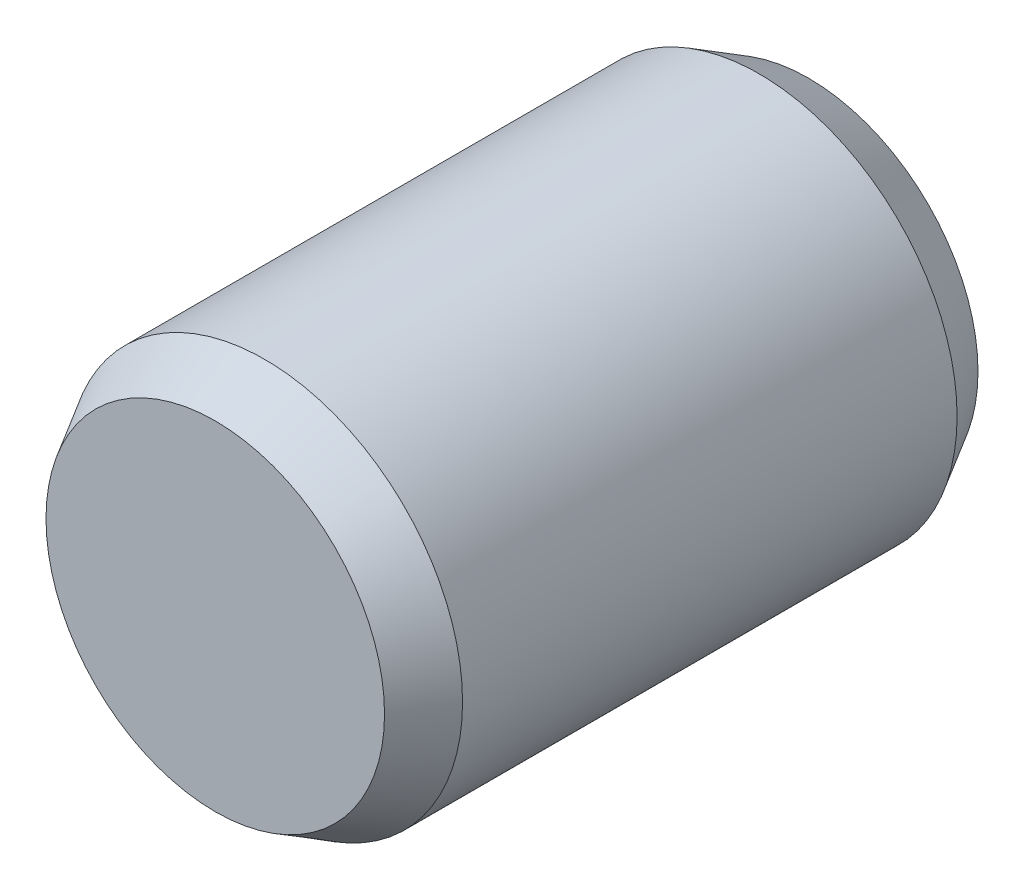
ISO-10303-21;
HEADER;
FILE_DESCRIPTION(('STEP AP214'),'2;1');
FILE_NAME('part.step','',(''),(''),'','','');
FILE_SCHEMA(('AUTOMOTIVE_DESIGN { 1 0 10303 214 1 1 1 1 }'));
ENDSEC;
DATA;
#1=APPLICATION_CONTEXT('core data for automotive mechanical design processes');
#2=APPLICATION_PROTOCOL_DEFINITION('international standard','automotive_design',2000,#1);
#3=PRODUCT_CONTEXT('',#1,'mechanical');
#4=PRODUCT('Part','Part','',(#3));
#5=PRODUCT_RELATED_PRODUCT_CATEGORY('part','',(#4));
#6=PRODUCT_DEFINITION_FORMATION('','',#4);
#7=PRODUCT_DEFINITION_CONTEXT('part definition',#1,'design');
#8=PRODUCT_DEFINITION('design','',#6,#7);
#9=PRODUCT_DEFINITION_SHAPE('','',#8);
#10=(LENGTH_UNIT() NAMED_UNIT(*) SI_UNIT(.MILLI.,.METRE.));
#11=(NAMED_UNIT(*) PLANE_ANGLE_UNIT() SI_UNIT($,.RADIAN.));
#12=(NAMED_UNIT(*) SI_UNIT($,.STERADIAN.) SOLID_ANGLE_UNIT());
#13=UNCERTAINTY_MEASURE_WITH_UNIT(LENGTH_MEASURE(1.E-05),#10,'distance_accuracy_value','');
#14=(GEOMETRIC_REPRESENTATION_CONTEXT(3) GLOBAL_UNCERTAINTY_ASSIGNED_CONTEXT((#13)) GLOBAL_UNIT_ASSIGNED_CONTEXT((#10,
#11,#12)) REPRESENTATION_CONTEXT('',''));
#15=CARTESIAN_POINT('',(0.,0.,0.));
#16=DIRECTION('',(0.,0.,1.));
#17=DIRECTION('',(1.,0.,0.));
#18=AXIS2_PLACEMENT_3D('',#15,#16,#17);
#19=CARTESIAN_POINT('',(50.,10.,12.));
#20=DIRECTION('',(0.,0.,-1.));
#21=DIRECTION('',(-1.,0.,0.));
#22=AXIS2_PLACEMENT_3D('',#19,#20,#21);
#23=CYLINDRICAL_SURFACE('',#22,4.00000000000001);
#24=CARTESIAN_POINT('',(50.,10.,1.));
#25=DIRECTION('',(0.,0.,1.));
#26=DIRECTION('',(1.,0.,0.));
#27=AXIS2_PLACEMENT_3D('',#24,#25,#26);
#28=CIRCLE('',#27,4.00000000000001);
#29=CARTESIAN_POINT('',(54.,10.,1.));
#30=VERTEX_POINT('',#29);
#31=EDGE_CURVE('E32',#30,#30,#28,.T.);
#32=ORIENTED_EDGE('',*,*,#31,.T.);
#33=EDGE_LOOP('',(#32));
#34=FACE_BOUND('',#33,.T.);
#35=CARTESIAN_POINT('',(50.,10.,11.));
#36=DIRECTION('',(0.,0.,1.));
#37=DIRECTION('',(1.,0.,0.));
#38=AXIS2_PLACEMENT_3D('',#35,#36,#37);
#39=CIRCLE('',#38,4.00000000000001);
#40=CARTESIAN_POINT('',(54.,10.,11.));
#41=VERTEX_POINT('',#40);
#42=EDGE_CURVE('E36',#41,#41,#39,.F.);
#43=ORIENTED_EDGE('',*,*,#42,.T.);
#44=EDGE_LOOP('',(#43));
#45=FACE_BOUND('',#44,.T.);
#46=ADVANCED_FACE('F22',(#34,#45),#23,.T.);
#47=CARTESIAN_POINT('',(50.,10.,12.));
#48=DIRECTION('',(0.,0.,1.));
#49=DIRECTION('',(1.,0.,0.));
#50=AXIS2_PLACEMENT_3D('',#47,#48,#49);
#51=PLANE('',#50);
#52=CARTESIAN_POINT('',(50.,10.,12.));
#53=DIRECTION('',(0.,0.,1.));
#54=DIRECTION('',(1.,0.,0.));
#55=AXIS2_PLACEMENT_3D('',#52,#53,#54);
#56=CIRCLE('',#55,3.42264973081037);
#57=CARTESIAN_POINT('',(53.4226497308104,10.,12.));
#58=VERTEX_POINT('',#57);
#59=EDGE_CURVE('E10',#58,#58,#56,.T.);
#60=ORIENTED_EDGE('',*,*,#59,.T.);
#61=EDGE_LOOP('',(#60));
#62=FACE_BOUND('',#61,.T.);
#63=ADVANCED_FACE('F54',(#62),#51,.T.);
#64=CARTESIAN_POINT('',(50.,10.,0.));
#65=DIRECTION('',(0.,0.,1.));
#66=DIRECTION('',(1.,0.,0.));
#67=AXIS2_PLACEMENT_3D('',#64,#65,#66);
#68=PLANE('',#67);
#69=CARTESIAN_POINT('',(50.,10.,0.));
#70=DIRECTION('',(0.,0.,1.));
#71=DIRECTION('',(1.,0.,0.));
#72=AXIS2_PLACEMENT_3D('',#69,#70,#71);
#73=CIRCLE('',#72,3.42264973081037);
#74=CARTESIAN_POINT('',(53.4226497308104,10.,0.));
#75=VERTEX_POINT('',#74);
#76=EDGE_CURVE('E28',#75,#75,#73,.F.);
#77=ORIENTED_EDGE('',*,*,#76,.T.);
#78=EDGE_LOOP('',(#77));
#79=FACE_BOUND('',#78,.T.);
#80=ADVANCED_FACE('F51',(#79),#68,.F.);
#81=CARTESIAN_POINT('',(50.,10.,1.));
#82=DIRECTION('',(0.,0.,1.));
#83=DIRECTION('',(1.,0.,0.));
#84=AXIS2_PLACEMENT_3D('',#81,#82,#83);
#85=CONICAL_SURFACE('',#84,4.00000000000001,0.523598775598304);
#86=ORIENTED_EDGE('',*,*,#76,.F.);
#87=EDGE_LOOP('',(#86));
#88=FACE_BOUND('',#87,.T.);
#89=ORIENTED_EDGE('',*,*,#31,.F.);
#90=EDGE_LOOP('',(#89));
#91=FACE_BOUND('',#90,.T.);
#92=ADVANCED_FACE('F46',(#88,#91),#85,.T.);
#93=CARTESIAN_POINT('',(50.,10.,12.));
#94=DIRECTION('',(0.,0.,-1.));
#95=DIRECTION('',(-1.,0.,0.));
#96=AXIS2_PLACEMENT_3D('',#93,#94,#95);
#97=CONICAL_SURFACE('',#96,3.42264973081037,0.523598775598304);
#98=ORIENTED_EDGE('',*,*,#42,.F.);
#99=EDGE_LOOP('',(#98));
#100=FACE_BOUND('',#99,.T.);
#101=ORIENTED_EDGE('',*,*,#59,.F.);
#102=EDGE_LOOP('',(#101));
#103=FACE_BOUND('',#102,.T.);
#104=ADVANCED_FACE('F43',(#100,#103),#97,.T.);
#105=CLOSED_SHELL('',(#46,#63,#80,#92,#104));
#106=MANIFOLD_SOLID_BREP('B2',#105);
#107=ADVANCED_BREP_SHAPE_REPRESENTATION('',(#18,#106),#14);
#108=SHAPE_DEFINITION_REPRESENTATION(#9,#107);
ENDSEC;
END-ISO-10303-21;
